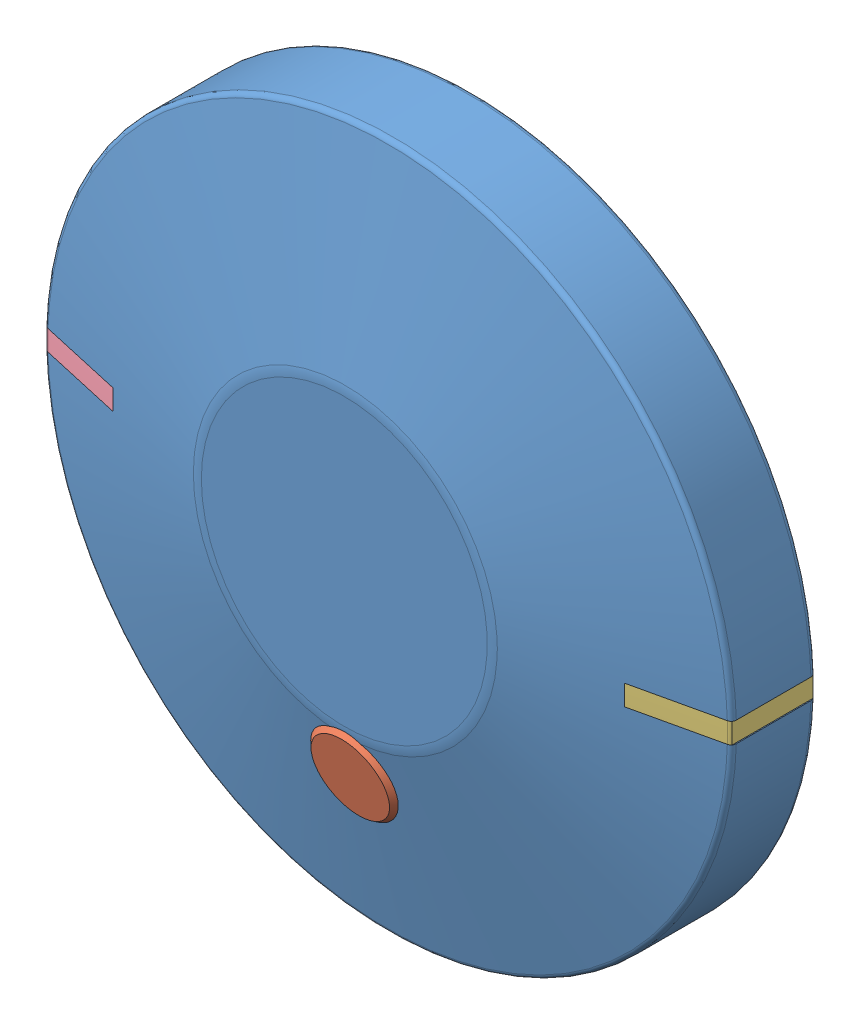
SolidWorks assembly HERE GPS.SLDASM, configuration Default (file format 10000). Lengths in mm.
Overall size (67.26 67.23 17.04).
4 component instances, 4 part files, 0 mates.
Components (placement in the parent):
- Component1-1: Component1.sldprt [Default] at origin size (67.26 67.23 16.8)
- Component2-1: Component2.sldprt [Default] at origin size (8.5 8.84 4.72)
- Component3-1: Component3.sldprt [Default] at origin size (8.52 2 12.06)
- Component5-1: Component5.sldprt [Default] at origin size (8.65 2 12.06)
